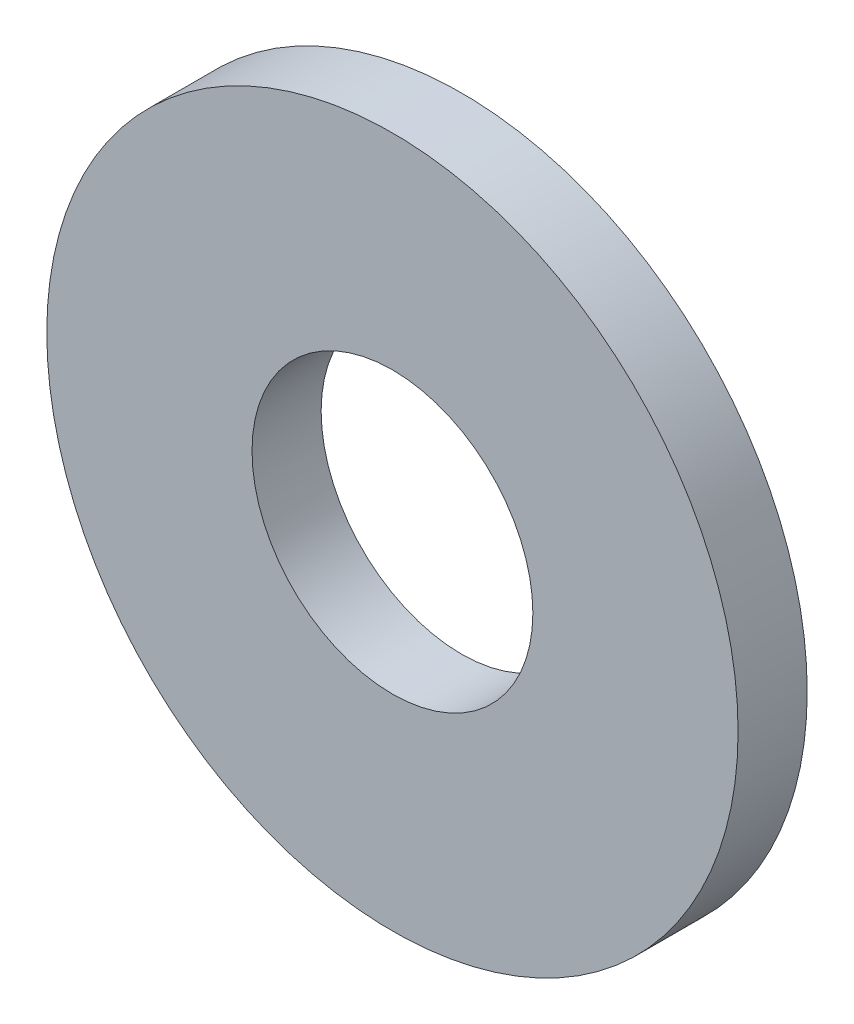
ISO-10303-21;
HEADER;
FILE_DESCRIPTION(('STEP AP214'),'2;1');
FILE_NAME('part.step','',(''),(''),'','','');
FILE_SCHEMA(('AUTOMOTIVE_DESIGN { 1 0 10303 214 1 1 1 1 }'));
ENDSEC;
DATA;
#1=APPLICATION_CONTEXT('core data for automotive mechanical design processes');
#2=APPLICATION_PROTOCOL_DEFINITION('international standard','automotive_design',2000,#1);
#3=PRODUCT_CONTEXT('',#1,'mechanical');
#4=PRODUCT('Part','Part','',(#3));
#5=PRODUCT_RELATED_PRODUCT_CATEGORY('part','',(#4));
#6=PRODUCT_DEFINITION_FORMATION('','',#4);
#7=PRODUCT_DEFINITION_CONTEXT('part definition',#1,'design');
#8=PRODUCT_DEFINITION('design','',#6,#7);
#9=PRODUCT_DEFINITION_SHAPE('','',#8);
#10=(LENGTH_UNIT() NAMED_UNIT(*) SI_UNIT(.MILLI.,.METRE.));
#11=(NAMED_UNIT(*) PLANE_ANGLE_UNIT() SI_UNIT($,.RADIAN.));
#12=(NAMED_UNIT(*) SI_UNIT($,.STERADIAN.) SOLID_ANGLE_UNIT());
#13=UNCERTAINTY_MEASURE_WITH_UNIT(LENGTH_MEASURE(1.E-05),#10,'distance_accuracy_value','');
#14=(GEOMETRIC_REPRESENTATION_CONTEXT(3) GLOBAL_UNCERTAINTY_ASSIGNED_CONTEXT((#13)) GLOBAL_UNIT_ASSIGNED_CONTEXT((#10,
#11,#12)) REPRESENTATION_CONTEXT('',''));
#15=CARTESIAN_POINT('',(0.,0.,0.));
#16=DIRECTION('',(0.,0.,1.));
#17=DIRECTION('',(1.,0.,0.));
#18=AXIS2_PLACEMENT_3D('',#15,#16,#17);
#19=CARTESIAN_POINT('',(0.,0.,0.4));
#20=DIRECTION('',(0.,0.,1.));
#21=DIRECTION('',(1.,0.,0.));
#22=AXIS2_PLACEMENT_3D('',#19,#20,#21);
#23=PLANE('',#22);
#24=CARTESIAN_POINT('',(0.,0.,0.4));
#25=DIRECTION('',(0.,0.,1.));
#26=DIRECTION('',(1.,0.,0.));
#27=AXIS2_PLACEMENT_3D('',#24,#25,#26);
#28=CIRCLE('',#27,4.);
#29=CARTESIAN_POINT('',(4.,0.,0.4));
#30=VERTEX_POINT('',#29);
#31=EDGE_CURVE('E10',#30,#30,#28,.T.);
#32=ORIENTED_EDGE('',*,*,#31,.T.);
#33=EDGE_LOOP('',(#32));
#34=FACE_BOUND('',#33,.T.);
#35=CARTESIAN_POINT('',(0.,0.,0.4));
#36=DIRECTION('',(0.,0.,1.));
#37=DIRECTION('',(1.,0.,0.));
#38=AXIS2_PLACEMENT_3D('',#35,#36,#37);
#39=CIRCLE('',#38,1.625);
#40=CARTESIAN_POINT('',(1.625,0.,0.4));
#41=VERTEX_POINT('',#40);
#42=EDGE_CURVE('E40',#41,#41,#39,.T.);
#43=ORIENTED_EDGE('',*,*,#42,.F.);
#44=EDGE_LOOP('',(#43));
#45=FACE_BOUND('',#44,.T.);
#46=ADVANCED_FACE('F29',(#34,#45),#23,.T.);
#47=CARTESIAN_POINT('',(0.,0.,-0.4));
#48=DIRECTION('',(0.,0.,1.));
#49=DIRECTION('',(1.,0.,0.));
#50=AXIS2_PLACEMENT_3D('',#47,#48,#49);
#51=PLANE('',#50);
#52=CARTESIAN_POINT('',(0.,0.,-0.4));
#53=DIRECTION('',(0.,0.,1.));
#54=DIRECTION('',(1.,0.,0.));
#55=AXIS2_PLACEMENT_3D('',#52,#53,#54);
#56=CIRCLE('',#55,4.);
#57=CARTESIAN_POINT('',(4.,0.,-0.4));
#58=VERTEX_POINT('',#57);
#59=EDGE_CURVE('E36',#58,#58,#56,.T.);
#60=ORIENTED_EDGE('',*,*,#59,.F.);
#61=EDGE_LOOP('',(#60));
#62=FACE_BOUND('',#61,.T.);
#63=CARTESIAN_POINT('',(0.,0.,-0.4));
#64=DIRECTION('',(0.,0.,1.));
#65=DIRECTION('',(1.,0.,0.));
#66=AXIS2_PLACEMENT_3D('',#63,#64,#65);
#67=CIRCLE('',#66,1.625);
#68=CARTESIAN_POINT('',(1.625,0.,-0.4));
#69=VERTEX_POINT('',#68);
#70=EDGE_CURVE('E44',#69,#69,#67,.T.);
#71=ORIENTED_EDGE('',*,*,#70,.T.);
#72=EDGE_LOOP('',(#71));
#73=FACE_BOUND('',#72,.T.);
#74=ADVANCED_FACE('F50',(#62,#73),#51,.F.);
#75=CARTESIAN_POINT('',(0.,0.,0.4));
#76=DIRECTION('',(0.,0.,-1.));
#77=DIRECTION('',(-1.,0.,0.));
#78=AXIS2_PLACEMENT_3D('',#75,#76,#77);
#79=CYLINDRICAL_SURFACE('',#78,4.);
#80=ORIENTED_EDGE('',*,*,#31,.F.);
#81=EDGE_LOOP('',(#80));
#82=FACE_BOUND('',#81,.T.);
#83=ORIENTED_EDGE('',*,*,#59,.T.);
#84=EDGE_LOOP('',(#83));
#85=FACE_BOUND('',#84,.T.);
#86=ADVANCED_FACE('F31',(#82,#85),#79,.T.);
#87=CARTESIAN_POINT('',(0.,0.,0.4));
#88=DIRECTION('',(0.,0.,-1.));
#89=DIRECTION('',(-1.,0.,0.));
#90=AXIS2_PLACEMENT_3D('',#87,#88,#89);
#91=CYLINDRICAL_SURFACE('',#90,1.625);
#92=ORIENTED_EDGE('',*,*,#42,.T.);
#93=EDGE_LOOP('',(#92));
#94=FACE_BOUND('',#93,.T.);
#95=ORIENTED_EDGE('',*,*,#70,.F.);
#96=EDGE_LOOP('',(#95));
#97=FACE_BOUND('',#96,.T.);
#98=ADVANCED_FACE('F52',(#94,#97),#91,.F.);
#99=CLOSED_SHELL('',(#46,#74,#86,#98));
#100=MANIFOLD_SOLID_BREP('B2',#99);
#101=ADVANCED_BREP_SHAPE_REPRESENTATION('',(#18,#100),#14);
#102=SHAPE_DEFINITION_REPRESENTATION(#9,#101);
ENDSEC;
END-ISO-10303-21;
